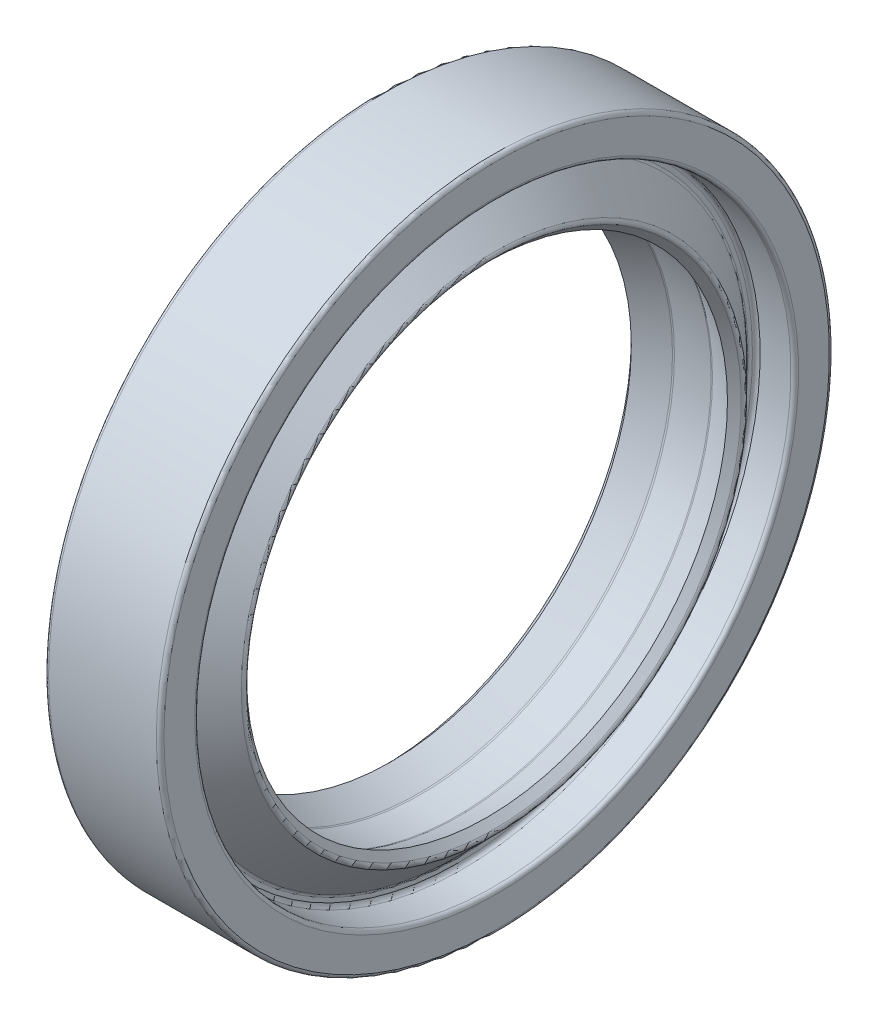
from build123d import *

# Parameters (mm, degrees)
CONG_1_R = 0.2


with BuildPart() as part:
    # Esquisse1 → Base-R_volution (revolve)
    with BuildSketch(Plane.XY, mode=Mode.PRIVATE) as base_r_volution_sk:
        Polygon((2, 13.2), (0.5, 12.5), (0, 13), (2, 15), (2, 15.5), (0, 15.5), (0, 17.5), (6, 17.5), (6, 15.5), (4, 15.5), (4, 15), (6, 13), (5.5, 12.5), (4, 13.2), align=None)
    revolve(base_r_volution_sk.sketch.rotate(Axis((-58.097424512, 0, 0), (1, 0, 0)), 90), axis=Axis((-58.097424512, 0, 0), (1, 0, 0)))

    # Cong_1
    cong_1_edges = [part.edges().sort_by_distance(p)[0] for p in [
        (2, 0, -13.2),
        (0, 0, -13),
        (2, 0, -15),
        (2, 0, -15.5),
        (0, 0, -15.5),
        (0, 0, -17.5),
        (6, 0, -17.5),
        (6, 0, -15.5),
        (4, 0, -15.5),
        (4, 0, -15),
        (6, 0, -13),
        (4, 0, -13.2),
    ]]
    fillet(cong_1_edges, radius=CONG_1_R)


solid = part.part
